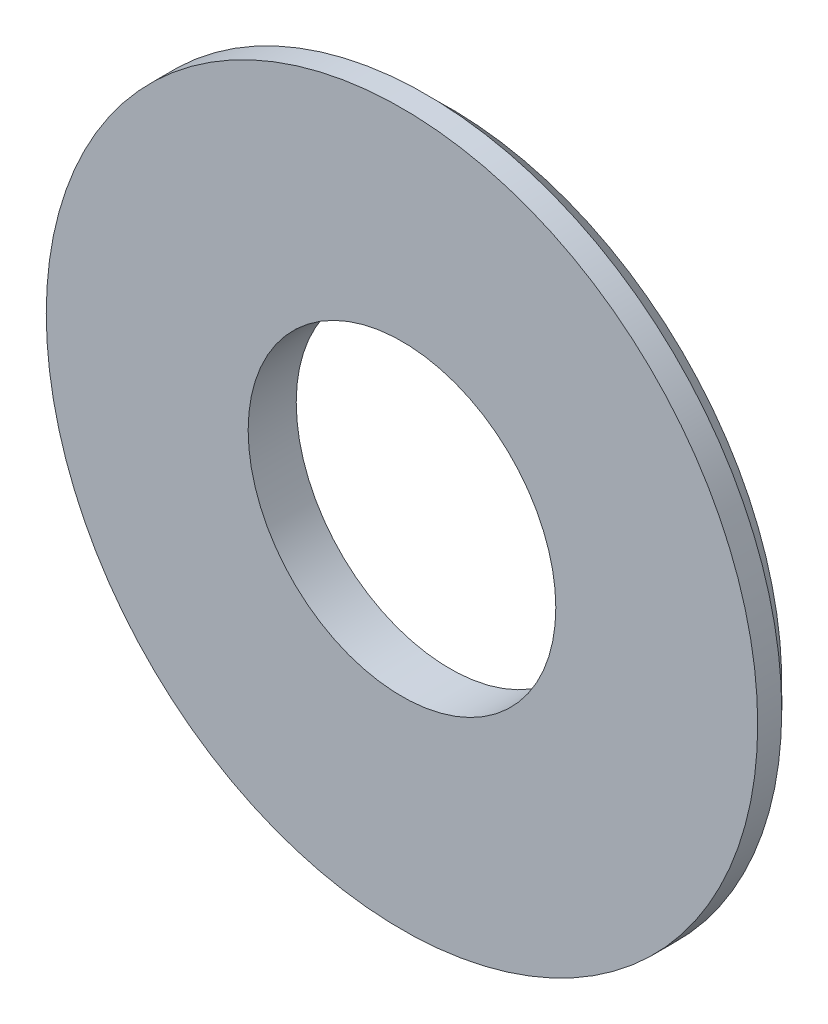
from build123d import *


with BuildPart() as part:
    # Croquis1 → Revoluci_n1 (revolve)
    with BuildSketch(Plane.XZ.offset(-25.340278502), mode=Mode.PRIVATE) as revoluci_n1_sk:
        Polygon((-802.827256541, -108.123824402), (-802.577256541, -107.873824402), (-802.577256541, -107.623824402), (-804.677256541, -107.623824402), (-804.677256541, -108.123824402), align=None)
    revolve(revoluci_n1_sk.sketch.rotate(Axis((-806.277256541, 25.340278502, -107.623824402), (0, 0, -1)), 180), axis=Axis((-806.277256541, 25.340278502, -107.623824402), (0, 0, -1)))


solid = part.part
